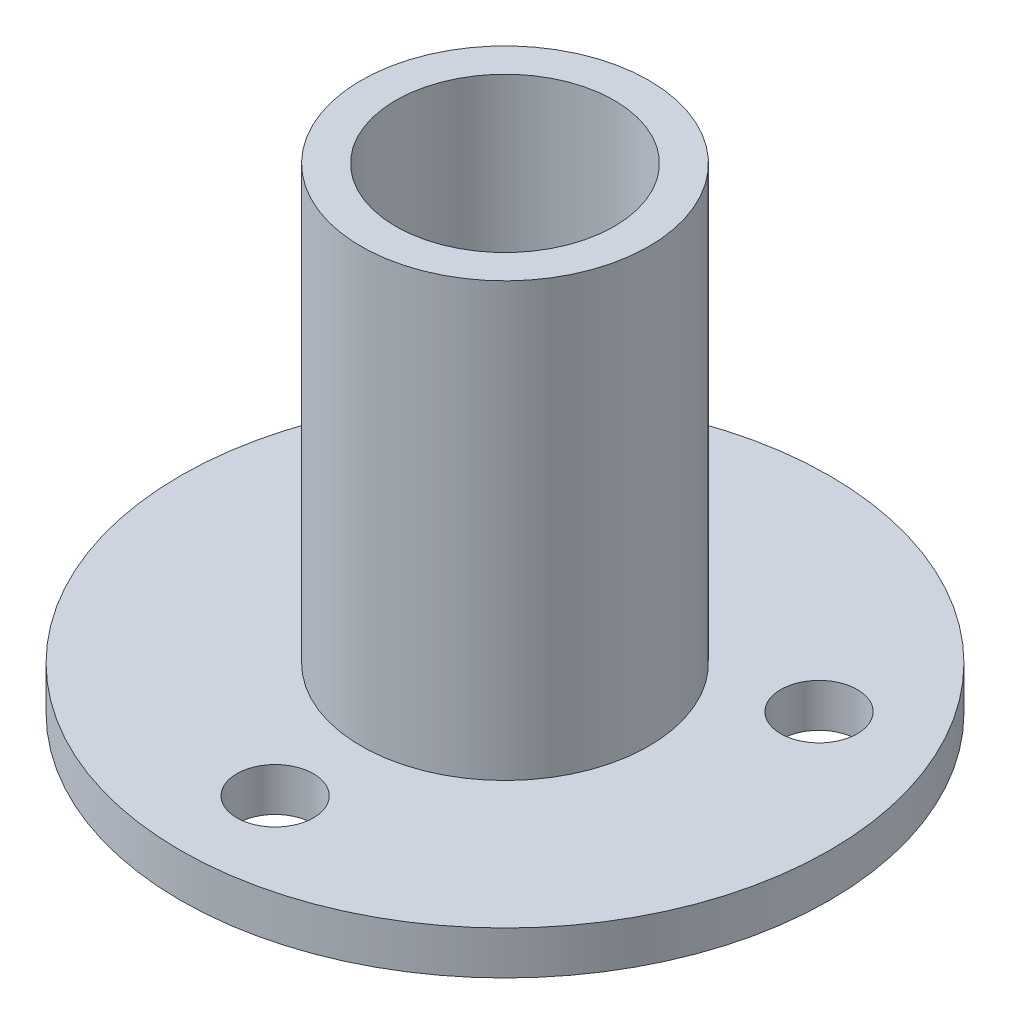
ISO-10303-21;
HEADER;
FILE_DESCRIPTION(('STEP AP214'),'2;1');
FILE_NAME('part.step','',(''),(''),'','','');
FILE_SCHEMA(('AUTOMOTIVE_DESIGN { 1 0 10303 214 1 1 1 1 }'));
ENDSEC;
DATA;
#1=APPLICATION_CONTEXT('core data for automotive mechanical design processes');
#2=APPLICATION_PROTOCOL_DEFINITION('international standard','automotive_design',2000,#1);
#3=PRODUCT_CONTEXT('',#1,'mechanical');
#4=PRODUCT('Part','Part','',(#3));
#5=PRODUCT_RELATED_PRODUCT_CATEGORY('part','',(#4));
#6=PRODUCT_DEFINITION_FORMATION('','',#4);
#7=PRODUCT_DEFINITION_CONTEXT('part definition',#1,'design');
#8=PRODUCT_DEFINITION('design','',#6,#7);
#9=PRODUCT_DEFINITION_SHAPE('','',#8);
#10=(LENGTH_UNIT() NAMED_UNIT(*) SI_UNIT(.MILLI.,.METRE.));
#11=(NAMED_UNIT(*) PLANE_ANGLE_UNIT() SI_UNIT($,.RADIAN.));
#12=(NAMED_UNIT(*) SI_UNIT($,.STERADIAN.) SOLID_ANGLE_UNIT());
#13=UNCERTAINTY_MEASURE_WITH_UNIT(LENGTH_MEASURE(1.E-05),#10,'distance_accuracy_value','');
#14=(GEOMETRIC_REPRESENTATION_CONTEXT(3) GLOBAL_UNCERTAINTY_ASSIGNED_CONTEXT((#13)) GLOBAL_UNIT_ASSIGNED_CONTEXT((#10,
#11,#12)) REPRESENTATION_CONTEXT('',''));
#15=CARTESIAN_POINT('',(0.,0.,0.));
#16=DIRECTION('',(0.,0.,1.));
#17=DIRECTION('',(1.,0.,0.));
#18=AXIS2_PLACEMENT_3D('',#15,#16,#17);
#19=CARTESIAN_POINT('',(-6.490462,4.444746,-6.490462));
#20=DIRECTION('',(0.,1.,0.));
#21=DIRECTION('',(0.,0.,1.));
#22=AXIS2_PLACEMENT_3D('',#19,#20,#21);
#23=PLANE('',#22);
#24=CARTESIAN_POINT('',(0.,4.444746,0.));
#25=DIRECTION('',(0.,-1.,0.));
#26=DIRECTION('',(0.,0.,-1.));
#27=AXIS2_PLACEMENT_3D('',#24,#25,#26);
#28=CIRCLE('',#27,6.4135);
#29=CARTESIAN_POINT('',(0.,4.444746,-6.4135));
#30=VERTEX_POINT('',#29);
#31=EDGE_CURVE('E18',#30,#30,#28,.T.);
#32=ORIENTED_EDGE('',*,*,#31,.F.);
#33=EDGE_LOOP('',(#32));
#34=FACE_BOUND('',#33,.T.);
#35=ADVANCED_FACE('F14',(#34),#23,.T.);
#36=CARTESIAN_POINT('',(0.,27.94,0.));
#37=DIRECTION('',(0.,-1.,0.));
#38=DIRECTION('',(0.,0.,-1.));
#39=AXIS2_PLACEMENT_3D('',#36,#37,#38);
#40=CYLINDRICAL_SURFACE('',#39,6.4135);
#41=CARTESIAN_POINT('',(0.,27.94,0.));
#42=DIRECTION('',(0.,-1.,0.));
#43=DIRECTION('',(0.,0.,-1.));
#44=AXIS2_PLACEMENT_3D('',#41,#42,#43);
#45=CIRCLE('',#44,6.4135);
#46=CARTESIAN_POINT('',(0.,27.94,-6.4135));
#47=VERTEX_POINT('',#46);
#48=EDGE_CURVE('E52',#47,#47,#45,.T.);
#49=ORIENTED_EDGE('',*,*,#48,.F.);
#50=EDGE_LOOP('',(#49));
#51=FACE_BOUND('',#50,.T.);
#52=ORIENTED_EDGE('',*,*,#31,.T.);
#53=EDGE_LOOP('',(#52));
#54=FACE_BOUND('',#53,.T.);
#55=ADVANCED_FACE('F59',(#51,#54),#40,.F.);
#56=CARTESIAN_POINT('',(-8.546846,27.94,-8.546846));
#57=DIRECTION('',(0.,1.,0.));
#58=DIRECTION('',(0.,0.,1.));
#59=AXIS2_PLACEMENT_3D('',#56,#57,#58);
#60=PLANE('',#59);
#61=ORIENTED_EDGE('',*,*,#48,.T.);
#62=EDGE_LOOP('',(#61));
#63=FACE_BOUND('',#62,.T.);
#64=CARTESIAN_POINT('',(0.,27.94,0.));
#65=DIRECTION('',(0.,-1.,0.));
#66=DIRECTION('',(0.,0.,-1.));
#67=AXIS2_PLACEMENT_3D('',#64,#65,#66);
#68=CIRCLE('',#67,8.4455);
#69=CARTESIAN_POINT('',(0.,27.94,-8.4455));
#70=VERTEX_POINT('',#69);
#71=EDGE_CURVE('E50',#70,#70,#68,.F.);
#72=ORIENTED_EDGE('',*,*,#71,.T.);
#73=EDGE_LOOP('',(#72));
#74=FACE_BOUND('',#73,.T.);
#75=ADVANCED_FACE('F67',(#63,#74),#60,.T.);
#76=CARTESIAN_POINT('',(0.,2.54,0.));
#77=DIRECTION('',(0.,-1.,0.));
#78=DIRECTION('',(0.,0.,-1.));
#79=AXIS2_PLACEMENT_3D('',#76,#77,#78);
#80=CYLINDRICAL_SURFACE('',#79,19.05);
#81=CARTESIAN_POINT('',(0.,0.,0.));
#82=DIRECTION('',(0.,-1.,0.));
#83=DIRECTION('',(0.,0.,-1.));
#84=AXIS2_PLACEMENT_3D('',#81,#82,#83);
#85=CIRCLE('',#84,19.05);
#86=CARTESIAN_POINT('',(0.,0.,-19.05));
#87=VERTEX_POINT('',#86);
#88=EDGE_CURVE('E47',#87,#87,#85,.F.);
#89=ORIENTED_EDGE('',*,*,#88,.T.);
#90=EDGE_LOOP('',(#89));
#91=FACE_BOUND('',#90,.T.);
#92=CARTESIAN_POINT('',(0.,2.54,0.));
#93=DIRECTION('',(0.,-1.,0.));
#94=DIRECTION('',(0.,0.,-1.));
#95=AXIS2_PLACEMENT_3D('',#92,#93,#94);
#96=CIRCLE('',#95,19.05);
#97=CARTESIAN_POINT('',(0.,2.54,-19.05));
#98=VERTEX_POINT('',#97);
#99=EDGE_CURVE('E38',#98,#98,#96,.F.);
#100=ORIENTED_EDGE('',*,*,#99,.F.);
#101=EDGE_LOOP('',(#100));
#102=FACE_BOUND('',#101,.T.);
#103=ADVANCED_FACE('F92',(#91,#102),#80,.T.);
#104=CARTESIAN_POINT('',(-11.6859302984,0.,-6.746875));
#105=DIRECTION('',(0.,1.,0.));
#106=DIRECTION('',(0.,0.,1.));
#107=AXIS2_PLACEMENT_3D('',#104,#105,#106);
#108=CYLINDRICAL_SURFACE('',#107,2.2479);
#109=CARTESIAN_POINT('',(-11.6859302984,2.54,-6.746875));
#110=DIRECTION('',(0.,1.,0.));
#111=DIRECTION('',(0.,0.,1.));
#112=AXIS2_PLACEMENT_3D('',#109,#110,#111);
#113=CIRCLE('',#112,2.2479);
#114=CARTESIAN_POINT('',(-11.6859302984,2.54,-4.498975));
#115=VERTEX_POINT('',#114);
#116=EDGE_CURVE('E35',#115,#115,#113,.F.);
#117=ORIENTED_EDGE('',*,*,#116,.F.);
#118=EDGE_LOOP('',(#117));
#119=FACE_BOUND('',#118,.T.);
#120=CARTESIAN_POINT('',(-11.6859302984,0.,-6.746875));
#121=DIRECTION('',(0.,1.,0.));
#122=DIRECTION('',(0.,0.,1.));
#123=AXIS2_PLACEMENT_3D('',#120,#121,#122);
#124=CIRCLE('',#123,2.2479);
#125=CARTESIAN_POINT('',(-11.6859302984,0.,-4.498975));
#126=VERTEX_POINT('',#125);
#127=EDGE_CURVE('E44',#126,#126,#124,.F.);
#128=ORIENTED_EDGE('',*,*,#127,.T.);
#129=EDGE_LOOP('',(#128));
#130=FACE_BOUND('',#129,.T.);
#131=ADVANCED_FACE('F88',(#119,#130),#108,.F.);
#132=CARTESIAN_POINT('',(0.,0.,13.49375));
#133=DIRECTION('',(0.,1.,0.));
#134=DIRECTION('',(0.,0.,1.));
#135=AXIS2_PLACEMENT_3D('',#132,#133,#134);
#136=CYLINDRICAL_SURFACE('',#135,2.24790000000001);
#137=CARTESIAN_POINT('',(0.,2.54,13.49375));
#138=DIRECTION('',(0.,1.,0.));
#139=DIRECTION('',(0.,0.,1.));
#140=AXIS2_PLACEMENT_3D('',#137,#138,#139);
#141=CIRCLE('',#140,2.24790000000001);
#142=CARTESIAN_POINT('',(0.,2.54,15.74165));
#143=VERTEX_POINT('',#142);
#144=EDGE_CURVE('E32',#143,#143,#141,.F.);
#145=ORIENTED_EDGE('',*,*,#144,.F.);
#146=EDGE_LOOP('',(#145));
#147=FACE_BOUND('',#146,.T.);
#148=CARTESIAN_POINT('',(0.,0.,13.49375));
#149=DIRECTION('',(0.,1.,0.));
#150=DIRECTION('',(0.,0.,1.));
#151=AXIS2_PLACEMENT_3D('',#148,#149,#150);
#152=CIRCLE('',#151,2.24790000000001);
#153=CARTESIAN_POINT('',(0.,0.,15.74165));
#154=VERTEX_POINT('',#153);
#155=EDGE_CURVE('E41',#154,#154,#152,.F.);
#156=ORIENTED_EDGE('',*,*,#155,.T.);
#157=EDGE_LOOP('',(#156));
#158=FACE_BOUND('',#157,.T.);
#159=ADVANCED_FACE('F84',(#147,#158),#136,.F.);
#160=CARTESIAN_POINT('',(0.,27.94,0.));
#161=DIRECTION('',(0.,-1.,0.));
#162=DIRECTION('',(0.,0.,-1.));
#163=AXIS2_PLACEMENT_3D('',#160,#161,#162);
#164=CYLINDRICAL_SURFACE('',#163,8.4455);
#165=CARTESIAN_POINT('',(0.,2.54,0.));
#166=DIRECTION('',(0.,-1.,0.));
#167=DIRECTION('',(0.,0.,-1.));
#168=AXIS2_PLACEMENT_3D('',#165,#166,#167);
#169=CIRCLE('',#168,8.4455);
#170=CARTESIAN_POINT('',(0.,2.54,-8.4455));
#171=VERTEX_POINT('',#170);
#172=EDGE_CURVE('E27',#171,#171,#169,.T.);
#173=ORIENTED_EDGE('',*,*,#172,.F.);
#174=EDGE_LOOP('',(#173));
#175=FACE_BOUND('',#174,.T.);
#176=ORIENTED_EDGE('',*,*,#71,.F.);
#177=EDGE_LOOP('',(#176));
#178=FACE_BOUND('',#177,.T.);
#179=ADVANCED_FACE('F81',(#175,#178),#164,.T.);
#180=CARTESIAN_POINT('',(-19.2786,0.,-19.2786));
#181=DIRECTION('',(0.,1.,0.));
#182=DIRECTION('',(0.,0.,1.));
#183=AXIS2_PLACEMENT_3D('',#180,#181,#182);
#184=PLANE('',#183);
#185=ORIENTED_EDGE('',*,*,#155,.F.);
#186=EDGE_LOOP('',(#185));
#187=FACE_BOUND('',#186,.T.);
#188=ORIENTED_EDGE('',*,*,#127,.F.);
#189=EDGE_LOOP('',(#188));
#190=FACE_BOUND('',#189,.T.);
#191=CARTESIAN_POINT('',(11.6859302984,0.,-6.746875));
#192=DIRECTION('',(0.,1.,0.));
#193=DIRECTION('',(0.,0.,1.));
#194=AXIS2_PLACEMENT_3D('',#191,#192,#193);
#195=CIRCLE('',#194,2.2479);
#196=CARTESIAN_POINT('',(11.6859302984,0.,-4.498975));
#197=VERTEX_POINT('',#196);
#198=EDGE_CURVE('E22',#197,#197,#195,.F.);
#199=ORIENTED_EDGE('',*,*,#198,.F.);
#200=EDGE_LOOP('',(#199));
#201=FACE_BOUND('',#200,.T.);
#202=ORIENTED_EDGE('',*,*,#88,.F.);
#203=EDGE_LOOP('',(#202));
#204=FACE_BOUND('',#203,.T.);
#205=ADVANCED_FACE('F77',(#187,#190,#201,#204),#184,.F.);
#206=CARTESIAN_POINT('',(-19.2786,2.54,-19.2786));
#207=DIRECTION('',(0.,1.,0.));
#208=DIRECTION('',(0.,0.,1.));
#209=AXIS2_PLACEMENT_3D('',#206,#207,#208);
#210=PLANE('',#209);
#211=ORIENTED_EDGE('',*,*,#172,.T.);
#212=EDGE_LOOP('',(#211));
#213=FACE_BOUND('',#212,.T.);
#214=ORIENTED_EDGE('',*,*,#144,.T.);
#215=EDGE_LOOP('',(#214));
#216=FACE_BOUND('',#215,.T.);
#217=ORIENTED_EDGE('',*,*,#116,.T.);
#218=EDGE_LOOP('',(#217));
#219=FACE_BOUND('',#218,.T.);
#220=CARTESIAN_POINT('',(11.6859302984,2.54,-6.746875));
#221=DIRECTION('',(0.,1.,0.));
#222=DIRECTION('',(0.,0.,1.));
#223=AXIS2_PLACEMENT_3D('',#220,#221,#222);
#224=CIRCLE('',#223,2.2479);
#225=CARTESIAN_POINT('',(11.6859302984,2.54,-4.498975));
#226=VERTEX_POINT('',#225);
#227=EDGE_CURVE('E9',#226,#226,#224,.T.);
#228=ORIENTED_EDGE('',*,*,#227,.F.);
#229=EDGE_LOOP('',(#228));
#230=FACE_BOUND('',#229,.T.);
#231=ORIENTED_EDGE('',*,*,#99,.T.);
#232=EDGE_LOOP('',(#231));
#233=FACE_BOUND('',#232,.T.);
#234=ADVANCED_FACE('F16',(#213,#216,#219,#230,#233),#210,.T.);
#235=CARTESIAN_POINT('',(11.6859302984,0.,-6.746875));
#236=DIRECTION('',(0.,1.,0.));
#237=DIRECTION('',(0.,0.,1.));
#238=AXIS2_PLACEMENT_3D('',#235,#236,#237);
#239=CYLINDRICAL_SURFACE('',#238,2.2479);
#240=ORIENTED_EDGE('',*,*,#227,.T.);
#241=EDGE_LOOP('',(#240));
#242=FACE_BOUND('',#241,.T.);
#243=ORIENTED_EDGE('',*,*,#198,.T.);
#244=EDGE_LOOP('',(#243));
#245=FACE_BOUND('',#244,.T.);
#246=ADVANCED_FACE('F71',(#242,#245),#239,.F.);
#247=CLOSED_SHELL('',(#35,#55,#75,#103,#131,#159,#179,#205,#234,#246));
#248=MANIFOLD_SOLID_BREP('B1',#247);
#249=ADVANCED_BREP_SHAPE_REPRESENTATION('',(#18,#248),#14);
#250=SHAPE_DEFINITION_REPRESENTATION(#9,#249);
ENDSEC;
END-ISO-10303-21;
